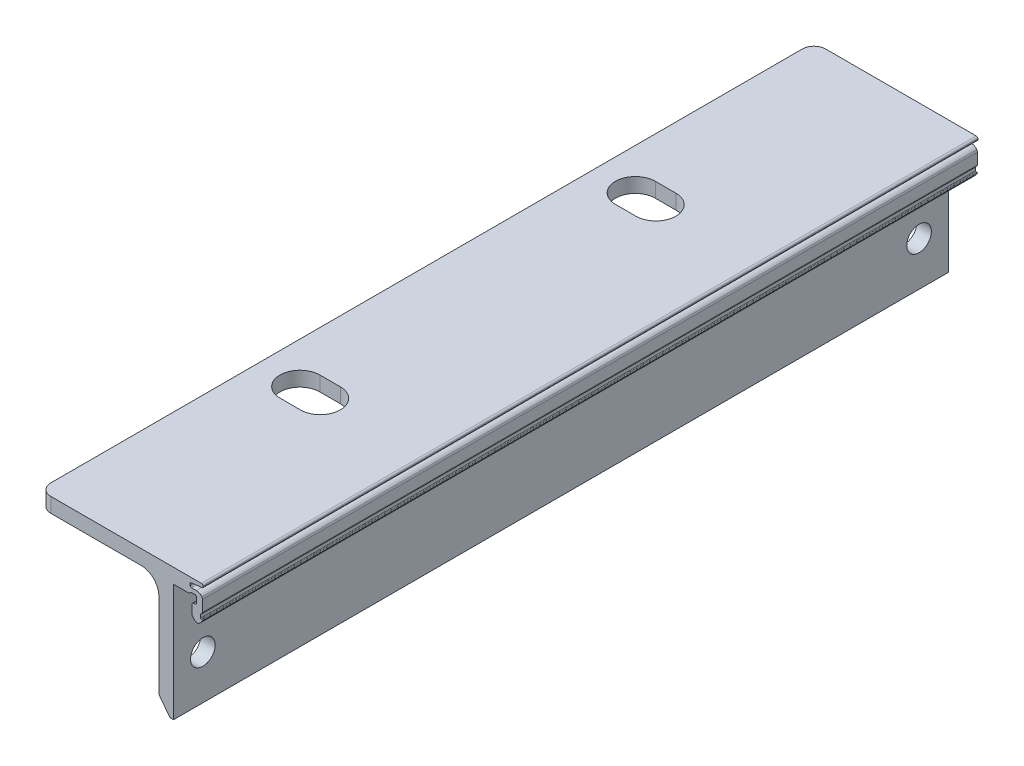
from build123d import *

# Parameters (mm, degrees)
EXTRUDE_1_DEPTH     = 66
FILLET_2_R          = 3
CUT_EXTRUDE_1_DEPTH = 2359.954854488
SKETCH_3_R          = 2.1
CUT_EXTRUDE_2_DEPTH = 3314.323995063
FILLET_1_R          = 2


with BuildPart() as part:
    # Sketch 1 → Extrude 1 (new, symmetric)
    with BuildSketch(Plane.XY):
        with BuildLine():
            Line((2329.984035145, -3290.103769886), (2355.384035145, -3290.103769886))
            Line((2355.384035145, -3290.103769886), (2357.624035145, -3290.103769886))
            ThreePointArc((2357.624035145, -3290.103769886), (2357.836167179, -3290.191637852), (2357.924035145, -3290.403769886))
            Line((2357.924035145, -3290.403769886), (2357.924035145, -3290.492459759))
            ThreePointArc((2357.924035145, -3290.492459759), (2357.87266411, -3290.626285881), (2357.744940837, -3290.691364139))
            Line((2357.744940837, -3290.691364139), (2355.903129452, -3290.884946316))
            ThreePointArc((2355.903129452, -3290.884946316), (2355.775406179, -3290.950024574), (2355.724035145, -3291.083850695))
            Line((2355.724035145, -3291.083850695), (2355.724035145, -3291.403769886))
            ThreePointArc((2355.724035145, -3291.403769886), (2355.782613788, -3291.545191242), (2355.924035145, -3291.603769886))
            Line((2355.924035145, -3291.603769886), (2356.769984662, -3291.603769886))
            ThreePointArc((2356.769984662, -3291.603769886), (2357.299096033, -3291.726717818), (2357.719785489, -3292.070367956))
            ThreePointArc((2357.719785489, -3292.070367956), (2357.797255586, -3292.214513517), (2357.824035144, -3292.375952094))
            Line((2357.824035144, -3292.375952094), (2357.824035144, -3294.273769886))
            ThreePointArc((2357.824035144, -3294.273769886), (2357.779946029, -3294.430325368), (2357.660637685, -3294.540864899))
            ThreePointArc((2357.660637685, -3294.540864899), (2357.54132934, -3294.65140443), (2357.497240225, -3294.807959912))
            Line((2357.497240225, -3294.807959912), (2357.497240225, -3295.307959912))
            ThreePointArc((2357.497240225, -3295.307959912), (2357.526529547, -3295.37867059), (2357.597240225, -3295.407959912))
            Line((2357.597240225, -3295.407959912), (2357.724035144, -3295.407959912))
            ThreePointArc((2357.724035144, -3295.407959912), (2357.794745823, -3295.437249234), (2357.824035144, -3295.507959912))
            Line((2357.824035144, -3295.507959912), (2357.824035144, -3295.527361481))
            ThreePointArc((2357.824035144, -3295.527361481), (2357.818000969, -3295.561572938), (2357.800626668, -3295.591655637))
            Line((2357.800626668, -3295.591655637), (2357.383057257, -3296.089092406))
            ThreePointArc((2357.383057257, -3296.089092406), (2356.924035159, -3296.303081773), (2356.465013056, -3296.089092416))
            Line((2356.465013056, -3296.089092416), (2356.094260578, -3295.647427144))
            ThreePointArc((2356.094260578, -3295.647427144), (2356.042137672, -3295.557179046), (2356.024035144, -3295.454544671))
            Line((2356.024035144, -3295.454544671), (2356.024035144, -3294.003769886))
            ThreePointArc((2356.024035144, -3294.003769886), (2356.11190311, -3293.791637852), (2356.324035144, -3293.703769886))
            Line((2356.324035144, -3293.703769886), (2356.524035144, -3293.703769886))
            ThreePointArc((2356.524035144, -3293.703769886), (2356.736167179, -3293.61590192), (2356.824035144, -3293.403769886))
            Line((2356.824035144, -3293.403769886), (2356.824035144, -3292.603769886))
            ThreePointArc((2356.824035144, -3292.603769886), (2356.736167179, -3292.391637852), (2356.524035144, -3292.303769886))
            Line((2356.524035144, -3292.303769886), (2355.987964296, -3292.303769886))
            ThreePointArc((2355.987964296, -3292.303769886), (2355.837964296, -3292.343962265), (2355.728156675, -3292.453769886))
            ThreePointArc((2355.728156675, -3292.453769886), (2355.618349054, -3292.563577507), (2355.468349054, -3292.603769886))
            Line((2355.468349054, -3292.603769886), (2355.384035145, -3292.603769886))
            Line((2355.384035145, -3292.603769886), (2352.884035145, -3292.603769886))
            Line((2352.884035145, -3292.603769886), (2352.884035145, -3312.603769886))
            Line((2352.884035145, -3312.603769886), (2352.284035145, -3312.603769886))
            Line((2352.284035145, -3312.603769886), (2350.384035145, -3310.103769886))
            Line((2350.384035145, -3310.103769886), (2350.384035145, -3292.603769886))
            Line((2350.384035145, -3292.603769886), (2329.984035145, -3292.603769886))
            Line((2329.984035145, -3292.603769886), (2329.984035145, -3290.103769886))
        make_face()
    extrude(amount=EXTRUDE_1_DEPTH, both=True)

    # Fillet 2
    fillet_2_edges = [part.edges().sort_by_distance(p)[0] for p in [
        (2350.384035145, -3292.603769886, 0),
    ]]
    fillet(fillet_2_edges, radius=FILLET_2_R)

    # Sketch 2 → Cut-Extrude 1 (cut, through all)
    with BuildSketch(Plane(origin=(0, -3290.103769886, 0), x_dir=(1, 0, 0), z_dir=(0, 1, 0))):
        with BuildLine():
            Line((2340.484035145, -25.175), (2336.984035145, -25.175))
            ThreePointArc((2336.984035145, -25.175), (2333.584035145, -28.575), (2336.984035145, -31.975))
            Line((2336.984035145, -31.975), (2340.484035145, -31.975))
            ThreePointArc((2340.484035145, -31.975), (2343.884035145, -28.575), (2340.484035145, -25.175))
        make_face()
        with BuildLine():
            Line((2340.484035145, 31.975), (2336.984035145, 31.975))
            ThreePointArc((2336.984035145, 31.975), (2333.584035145, 28.575), (2336.984035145, 25.175))
            Line((2336.984035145, 25.175), (2340.484035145, 25.175))
            ThreePointArc((2340.484035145, 25.175), (2343.884035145, 28.575), (2340.484035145, 31.975))
        make_face()
    extrude(amount=-CUT_EXTRUDE_1_DEPTH, mode=Mode.SUBTRACT)

    # Sketch 3 → Cut-Extrude 2 (cut, through all)
    with BuildSketch(Plane.ZY.offset(-2350.384035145)):
        with Locations(Location((-61, -3305.103769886, 0), (0, 0, 270))):
            Circle(SKETCH_3_R)
        with Locations(Location((61, -3305.103769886, 0), (0, 0, 270))):
            Circle(SKETCH_3_R)
    extrude(amount=-CUT_EXTRUDE_2_DEPTH, mode=Mode.SUBTRACT)

    # Fillet 1
    fillet_1_edges = [part.edges().sort_by_distance(p)[0] for p in [
        (2329.984035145, -3291.353769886, 66),
        (2329.984035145, -3291.353769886, -66),
    ]]
    fillet(fillet_1_edges, radius=FILLET_1_R)


solid = part.part
